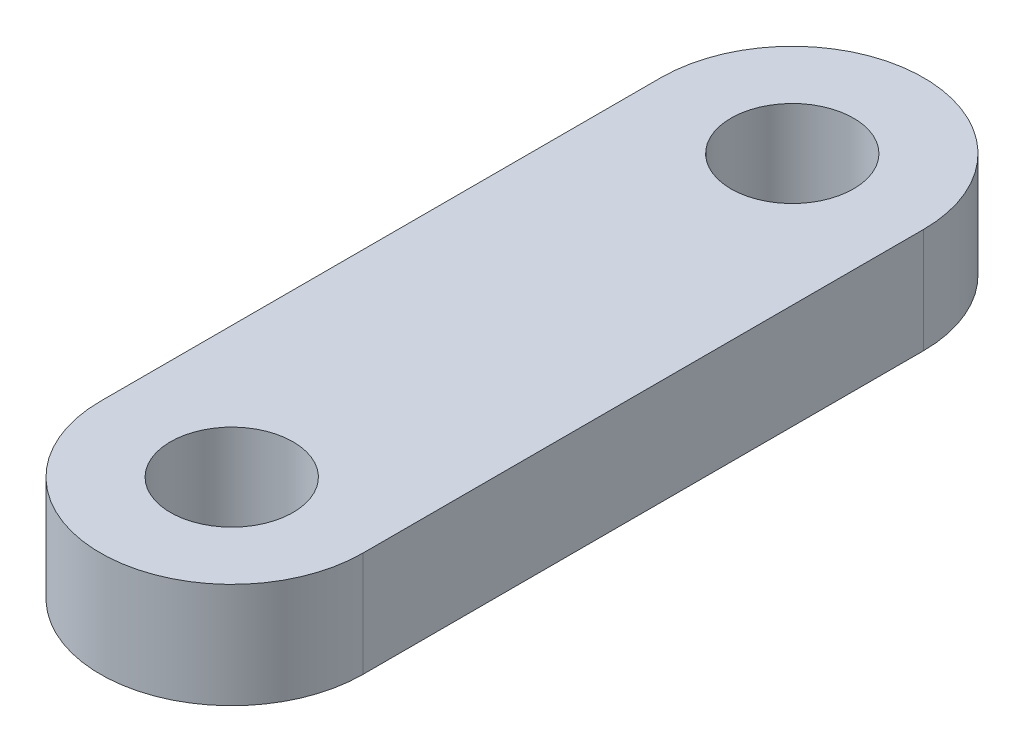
from build123d import *

# Parameters (mm, degrees)
SKETCH1_R           = 1.75
BOSS_EXTRUDE1_DEPTH = 3


with BuildPart() as part:
    # Sketch1 → Boss-Extrude1 (new body)
    with BuildSketch(Plane(origin=(0, 0, 0), x_dir=(1, 0, 0), z_dir=(0, 1, 0))):
        with BuildLine():
            Line((-3.75, 8), (-3.75, 0))
            Line((-3.75, 0), (3.75, 0))
            Line((3.75, 0), (3.75, 8))
            ThreePointArc((3.75, 8), (0, 11.75), (-3.75, 8))
        make_face()
        with Locations(Location((0, 8, 0), (0, 0, 270))):
            Circle(SKETCH1_R, mode=Mode.SUBTRACT)
    extrude(amount=BOSS_EXTRUDE1_DEPTH)

    # Mirror1: part across plane


with BuildPart() as part_1:
    add(part.part)
    add(part.part.mirror(Plane(origin=(-3.75, 3, 0), x_dir=(1, 0, 0), z_dir=(0, 0, -1))))


solid = part_1.part
